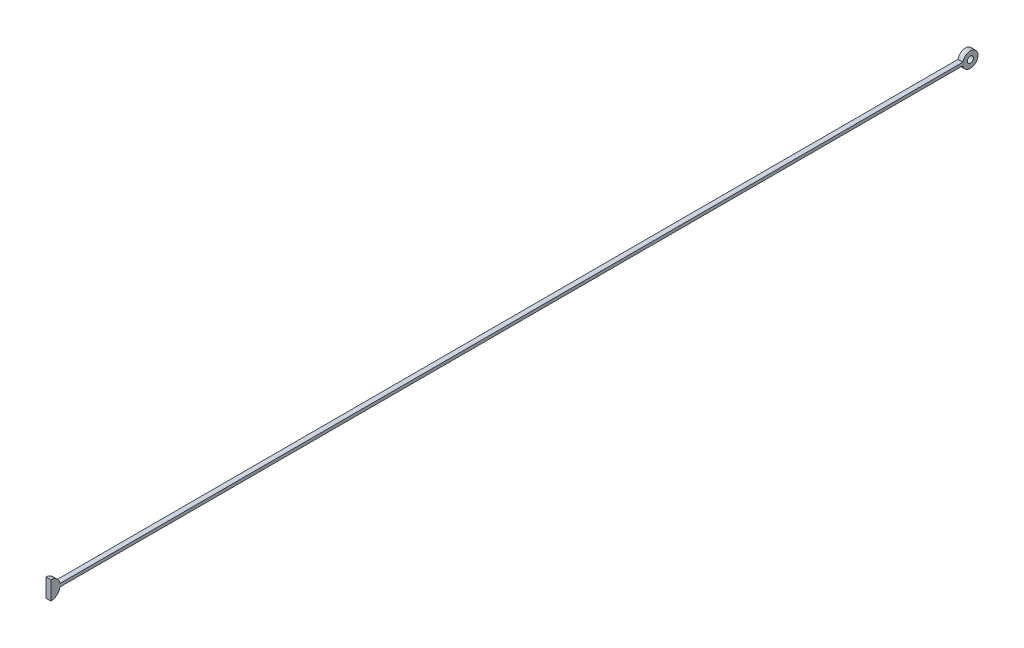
from build123d import *

# Parameters (mm, degrees)
SKETCH1_R           = 5
BOSS_EXTRUDE1_DEPTH = 8


with BuildPart() as part:
    # Sketch1 → Boss-Extrude1 (new body)
    with BuildSketch(Plane(origin=(0, 0, 0), x_dir=(0, 0, -1), z_dir=(1, 0, 0))):
        with BuildLine():
            Line((-1500, 15), (-1500, -15))
            ThreePointArc((-1500, -15), (-1490.317541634, -11.456439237), (-1485.209800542, -2.5))
            Line((-1485.209800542, -2.5), (-12.247448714, -2.5))
            ThreePointArc((-12.247448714, -2.5), (12.5, 0), (-12.247448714, 2.5))
            Line((-12.247448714, 2.5), (-1485.209800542, 2.5))
            ThreePointArc((-1485.209800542, 2.5), (-1490.317541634, 11.456439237), (-1500, 15))
        make_face()
        Circle(SKETCH1_R, mode=Mode.SUBTRACT)
    extrude(amount=BOSS_EXTRUDE1_DEPTH)


solid = part.part
